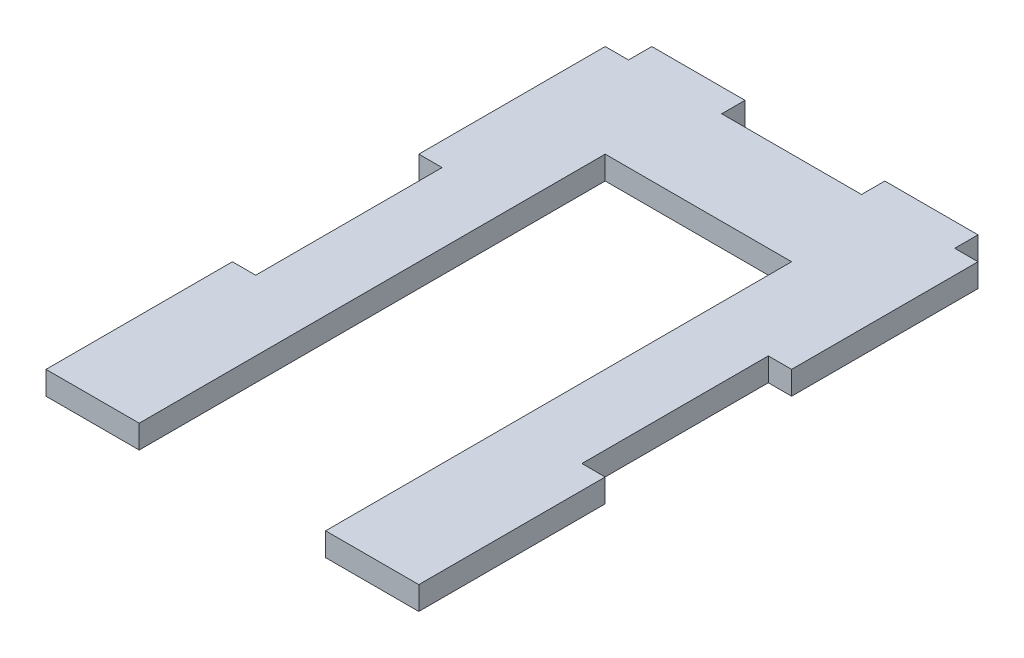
ISO-10303-21;
HEADER;
FILE_DESCRIPTION(('STEP AP214'),'2;1');
FILE_NAME('part.step','',(''),(''),'','','');
FILE_SCHEMA(('AUTOMOTIVE_DESIGN { 1 0 10303 214 1 1 1 1 }'));
ENDSEC;
DATA;
#1=APPLICATION_CONTEXT('core data for automotive mechanical design processes');
#2=APPLICATION_PROTOCOL_DEFINITION('international standard','automotive_design',2000,#1);
#3=PRODUCT_CONTEXT('',#1,'mechanical');
#4=PRODUCT('Part','Part','',(#3));
#5=PRODUCT_RELATED_PRODUCT_CATEGORY('part','',(#4));
#6=PRODUCT_DEFINITION_FORMATION('','',#4);
#7=PRODUCT_DEFINITION_CONTEXT('part definition',#1,'design');
#8=PRODUCT_DEFINITION('design','',#6,#7);
#9=PRODUCT_DEFINITION_SHAPE('','',#8);
#10=(LENGTH_UNIT() NAMED_UNIT(*) SI_UNIT(.MILLI.,.METRE.));
#11=(NAMED_UNIT(*) PLANE_ANGLE_UNIT() SI_UNIT($,.RADIAN.));
#12=(NAMED_UNIT(*) SI_UNIT($,.STERADIAN.) SOLID_ANGLE_UNIT());
#13=UNCERTAINTY_MEASURE_WITH_UNIT(LENGTH_MEASURE(1.E-05),#10,'distance_accuracy_value','');
#14=(GEOMETRIC_REPRESENTATION_CONTEXT(3) GLOBAL_UNCERTAINTY_ASSIGNED_CONTEXT((#13)) GLOBAL_UNIT_ASSIGNED_CONTEXT((#10,
#11,#12)) REPRESENTATION_CONTEXT('',''));
#15=CARTESIAN_POINT('',(0.,0.,0.));
#16=DIRECTION('',(0.,0.,1.));
#17=DIRECTION('',(1.,0.,0.));
#18=AXIS2_PLACEMENT_3D('',#15,#16,#17);
#19=CARTESIAN_POINT('',(-25.4,3.175,79.375));
#20=DIRECTION('',(1.,0.,0.));
#21=DIRECTION('',(0.,0.,-1.));
#22=AXIS2_PLACEMENT_3D('',#19,#20,#21);
#23=PLANE('',#22);
#24=DIRECTION('',(0.,0.,1.));
#25=VECTOR('',#24,1.);
#26=CARTESIAN_POINT('',(-25.4,0.,79.375));
#27=LINE('',#26,#25);
#28=CARTESIAN_POINT('',(-25.4,0.,53.975));
#29=VERTEX_POINT('',#28);
#30=CARTESIAN_POINT('',(-25.4,0.,79.375));
#31=VERTEX_POINT('',#30);
#32=EDGE_CURVE('E224',#29,#31,#27,.T.);
#33=ORIENTED_EDGE('',*,*,#32,.T.);
#34=DIRECTION('',(0.,-1.,0.));
#35=VECTOR('',#34,1.);
#36=CARTESIAN_POINT('',(-25.4,3.175,79.375));
#37=LINE('',#36,#35);
#38=CARTESIAN_POINT('',(-25.4,3.175,79.375));
#39=VERTEX_POINT('',#38);
#40=EDGE_CURVE('E11',#39,#31,#37,.T.);
#41=ORIENTED_EDGE('',*,*,#40,.F.);
#42=DIRECTION('',(0.,0.,1.));
#43=VECTOR('',#42,1.);
#44=CARTESIAN_POINT('',(-25.4,3.175,79.375));
#45=LINE('',#44,#43);
#46=CARTESIAN_POINT('',(-25.4,3.175,53.975));
#47=VERTEX_POINT('',#46);
#48=EDGE_CURVE('E271',#47,#39,#45,.T.);
#49=ORIENTED_EDGE('',*,*,#48,.F.);
#50=DIRECTION('',(0.,-1.,0.));
#51=VECTOR('',#50,1.);
#52=CARTESIAN_POINT('',(-25.4,3.175,53.975));
#53=LINE('',#52,#51);
#54=EDGE_CURVE('E220',#47,#29,#53,.T.);
#55=ORIENTED_EDGE('',*,*,#54,.T.);
#56=EDGE_LOOP('',(#33,#41,#49,#55));
#57=FACE_BOUND('',#56,.T.);
#58=ADVANCED_FACE('F32',(#57),#23,.F.);
#59=CARTESIAN_POINT('',(-22.225,3.175,79.375));
#60=DIRECTION('',(0.,0.,-1.));
#61=DIRECTION('',(-1.,0.,0.));
#62=AXIS2_PLACEMENT_3D('',#59,#60,#61);
#63=PLANE('',#62);
#64=DIRECTION('',(1.,0.,0.));
#65=VECTOR('',#64,1.);
#66=CARTESIAN_POINT('',(-22.225,0.,79.375));
#67=LINE('',#66,#65);
#68=CARTESIAN_POINT('',(-12.7,0.,79.375));
#69=VERTEX_POINT('',#68);
#70=EDGE_CURVE('E227',#31,#69,#67,.T.);
#71=ORIENTED_EDGE('',*,*,#70,.T.);
#72=DIRECTION('',(0.,-1.,0.));
#73=VECTOR('',#72,1.);
#74=CARTESIAN_POINT('',(-12.7,3.175,79.375));
#75=LINE('',#74,#73);
#76=CARTESIAN_POINT('',(-12.7,3.175,79.375));
#77=VERTEX_POINT('',#76);
#78=EDGE_CURVE('E40',#77,#69,#75,.T.);
#79=ORIENTED_EDGE('',*,*,#78,.F.);
#80=DIRECTION('',(1.,0.,0.));
#81=VECTOR('',#80,1.);
#82=CARTESIAN_POINT('',(-25.4,3.175,79.375));
#83=LINE('',#82,#81);
#84=EDGE_CURVE('E139',#39,#77,#83,.T.);
#85=ORIENTED_EDGE('',*,*,#84,.F.);
#86=ORIENTED_EDGE('',*,*,#40,.T.);
#87=EDGE_LOOP('',(#71,#79,#85,#86));
#88=FACE_BOUND('',#87,.T.);
#89=ADVANCED_FACE('F408',(#88),#63,.F.);
#90=CARTESIAN_POINT('',(-12.7,3.175,79.375));
#91=DIRECTION('',(-1.,0.,0.));
#92=DIRECTION('',(0.,0.,1.));
#93=AXIS2_PLACEMENT_3D('',#90,#91,#92);
#94=PLANE('',#93);
#95=DIRECTION('',(0.,0.,-1.));
#96=VECTOR('',#95,1.);
#97=CARTESIAN_POINT('',(-12.7,0.,79.375));
#98=LINE('',#97,#96);
#99=CARTESIAN_POINT('',(-12.7,0.,15.875));
#100=VERTEX_POINT('',#99);
#101=EDGE_CURVE('E229',#69,#100,#98,.T.);
#102=ORIENTED_EDGE('',*,*,#101,.T.);
#103=DIRECTION('',(0.,-1.,0.));
#104=VECTOR('',#103,1.);
#105=CARTESIAN_POINT('',(-12.7,3.175,15.875));
#106=LINE('',#105,#104);
#107=CARTESIAN_POINT('',(-12.7,3.175,15.875));
#108=VERTEX_POINT('',#107);
#109=EDGE_CURVE('E326',#108,#100,#106,.T.);
#110=ORIENTED_EDGE('',*,*,#109,.F.);
#111=DIRECTION('',(0.,0.,-1.));
#112=VECTOR('',#111,1.);
#113=CARTESIAN_POINT('',(-12.7,3.175,79.375));
#114=LINE('',#113,#112);
#115=EDGE_CURVE('E334',#77,#108,#114,.T.);
#116=ORIENTED_EDGE('',*,*,#115,.F.);
#117=ORIENTED_EDGE('',*,*,#78,.T.);
#118=EDGE_LOOP('',(#102,#110,#116,#117));
#119=FACE_BOUND('',#118,.T.);
#120=ADVANCED_FACE('F332',(#119),#94,.F.);
#121=CARTESIAN_POINT('',(-12.7,3.175,15.875));
#122=DIRECTION('',(0.,0.,-1.));
#123=DIRECTION('',(-1.,0.,0.));
#124=AXIS2_PLACEMENT_3D('',#121,#122,#123);
#125=PLANE('',#124);
#126=DIRECTION('',(1.,0.,0.));
#127=VECTOR('',#126,1.);
#128=CARTESIAN_POINT('',(-12.7,0.,15.875));
#129=LINE('',#128,#127);
#130=CARTESIAN_POINT('',(12.7,0.,15.875));
#131=VERTEX_POINT('',#130);
#132=EDGE_CURVE('E231',#100,#131,#129,.T.);
#133=ORIENTED_EDGE('',*,*,#132,.T.);
#134=DIRECTION('',(0.,-1.,0.));
#135=VECTOR('',#134,1.);
#136=CARTESIAN_POINT('',(12.7,3.175,15.875));
#137=LINE('',#136,#135);
#138=CARTESIAN_POINT('',(12.7,3.175,15.875));
#139=VERTEX_POINT('',#138);
#140=EDGE_CURVE('E323',#139,#131,#137,.T.);
#141=ORIENTED_EDGE('',*,*,#140,.F.);
#142=DIRECTION('',(1.,0.,0.));
#143=VECTOR('',#142,1.);
#144=CARTESIAN_POINT('',(-12.7,3.175,15.875));
#145=LINE('',#144,#143);
#146=EDGE_CURVE('E351',#108,#139,#145,.T.);
#147=ORIENTED_EDGE('',*,*,#146,.F.);
#148=ORIENTED_EDGE('',*,*,#109,.T.);
#149=EDGE_LOOP('',(#133,#141,#147,#148));
#150=FACE_BOUND('',#149,.T.);
#151=ADVANCED_FACE('F342',(#150),#125,.F.);
#152=CARTESIAN_POINT('',(12.7,3.175,79.375));
#153=DIRECTION('',(1.,0.,0.));
#154=DIRECTION('',(0.,0.,-1.));
#155=AXIS2_PLACEMENT_3D('',#152,#153,#154);
#156=PLANE('',#155);
#157=DIRECTION('',(0.,0.,1.));
#158=VECTOR('',#157,1.);
#159=CARTESIAN_POINT('',(12.7,0.,79.375));
#160=LINE('',#159,#158);
#161=CARTESIAN_POINT('',(12.7,0.,79.375));
#162=VERTEX_POINT('',#161);
#163=EDGE_CURVE('E233',#131,#162,#160,.T.);
#164=ORIENTED_EDGE('',*,*,#163,.T.);
#165=DIRECTION('',(0.,-1.,0.));
#166=VECTOR('',#165,1.);
#167=CARTESIAN_POINT('',(12.7,3.175,79.375));
#168=LINE('',#167,#166);
#169=CARTESIAN_POINT('',(12.7,3.175,79.375));
#170=VERTEX_POINT('',#169);
#171=EDGE_CURVE('E320',#170,#162,#168,.T.);
#172=ORIENTED_EDGE('',*,*,#171,.F.);
#173=DIRECTION('',(0.,0.,1.));
#174=VECTOR('',#173,1.);
#175=CARTESIAN_POINT('',(12.7,3.175,79.375));
#176=LINE('',#175,#174);
#177=EDGE_CURVE('E348',#139,#170,#176,.T.);
#178=ORIENTED_EDGE('',*,*,#177,.F.);
#179=ORIENTED_EDGE('',*,*,#140,.T.);
#180=EDGE_LOOP('',(#164,#172,#178,#179));
#181=FACE_BOUND('',#180,.T.);
#182=ADVANCED_FACE('F346',(#181),#156,.F.);
#183=CARTESIAN_POINT('',(25.4,3.175,79.375));
#184=DIRECTION('',(0.,0.,-1.));
#185=DIRECTION('',(-1.,0.,0.));
#186=AXIS2_PLACEMENT_3D('',#183,#184,#185);
#187=PLANE('',#186);
#188=DIRECTION('',(1.,0.,0.));
#189=VECTOR('',#188,1.);
#190=CARTESIAN_POINT('',(25.4,0.,79.375));
#191=LINE('',#190,#189);
#192=CARTESIAN_POINT('',(25.4,0.,79.375));
#193=VERTEX_POINT('',#192);
#194=EDGE_CURVE('E236',#162,#193,#191,.T.);
#195=ORIENTED_EDGE('',*,*,#194,.T.);
#196=DIRECTION('',(0.,-1.,0.));
#197=VECTOR('',#196,1.);
#198=CARTESIAN_POINT('',(25.4,3.175,79.375));
#199=LINE('',#198,#197);
#200=CARTESIAN_POINT('',(25.4,3.175,79.375));
#201=VERTEX_POINT('',#200);
#202=EDGE_CURVE('E317',#201,#193,#199,.T.);
#203=ORIENTED_EDGE('',*,*,#202,.F.);
#204=DIRECTION('',(1.,0.,0.));
#205=VECTOR('',#204,1.);
#206=CARTESIAN_POINT('',(12.7,3.175,79.375));
#207=LINE('',#206,#205);
#208=EDGE_CURVE('E350',#170,#201,#207,.T.);
#209=ORIENTED_EDGE('',*,*,#208,.F.);
#210=ORIENTED_EDGE('',*,*,#171,.T.);
#211=EDGE_LOOP('',(#195,#203,#209,#210));
#212=FACE_BOUND('',#211,.T.);
#213=ADVANCED_FACE('F421',(#212),#187,.F.);
#214=CARTESIAN_POINT('',(25.4,3.175,79.375));
#215=DIRECTION('',(-1.,0.,0.));
#216=DIRECTION('',(0.,0.,1.));
#217=AXIS2_PLACEMENT_3D('',#214,#215,#216);
#218=PLANE('',#217);
#219=DIRECTION('',(0.,0.,-1.));
#220=VECTOR('',#219,1.);
#221=CARTESIAN_POINT('',(25.4,0.,79.375));
#222=LINE('',#221,#220);
#223=CARTESIAN_POINT('',(25.4,0.,53.975));
#224=VERTEX_POINT('',#223);
#225=EDGE_CURVE('E238',#193,#224,#222,.T.);
#226=ORIENTED_EDGE('',*,*,#225,.T.);
#227=DIRECTION('',(0.,-1.,0.));
#228=VECTOR('',#227,1.);
#229=CARTESIAN_POINT('',(25.4,3.175,53.975));
#230=LINE('',#229,#228);
#231=CARTESIAN_POINT('',(25.4,3.175,53.975));
#232=VERTEX_POINT('',#231);
#233=EDGE_CURVE('E314',#232,#224,#230,.T.);
#234=ORIENTED_EDGE('',*,*,#233,.F.);
#235=DIRECTION('',(0.,0.,-1.));
#236=VECTOR('',#235,1.);
#237=CARTESIAN_POINT('',(25.4,3.175,79.375));
#238=LINE('',#237,#236);
#239=EDGE_CURVE('E353',#201,#232,#238,.T.);
#240=ORIENTED_EDGE('',*,*,#239,.F.);
#241=ORIENTED_EDGE('',*,*,#202,.T.);
#242=EDGE_LOOP('',(#226,#234,#240,#241));
#243=FACE_BOUND('',#242,.T.);
#244=ADVANCED_FACE('F424',(#243),#218,.F.);
#245=CARTESIAN_POINT('',(25.4,3.175,53.975));
#246=DIRECTION('',(0.,0.,1.));
#247=DIRECTION('',(1.,0.,0.));
#248=AXIS2_PLACEMENT_3D('',#245,#246,#247);
#249=PLANE('',#248);
#250=DIRECTION('',(-1.,0.,0.));
#251=VECTOR('',#250,1.);
#252=CARTESIAN_POINT('',(25.4,0.,53.975));
#253=LINE('',#252,#251);
#254=CARTESIAN_POINT('',(22.225,0.,53.975));
#255=VERTEX_POINT('',#254);
#256=EDGE_CURVE('E240',#224,#255,#253,.T.);
#257=ORIENTED_EDGE('',*,*,#256,.T.);
#258=DIRECTION('',(0.,-1.,0.));
#259=VECTOR('',#258,1.);
#260=CARTESIAN_POINT('',(22.225,3.175,53.975));
#261=LINE('',#260,#259);
#262=CARTESIAN_POINT('',(22.225,3.175,53.975));
#263=VERTEX_POINT('',#262);
#264=EDGE_CURVE('E311',#263,#255,#261,.T.);
#265=ORIENTED_EDGE('',*,*,#264,.F.);
#266=DIRECTION('',(-1.,0.,0.));
#267=VECTOR('',#266,1.);
#268=CARTESIAN_POINT('',(25.4,3.175,53.975));
#269=LINE('',#268,#267);
#270=EDGE_CURVE('E359',#232,#263,#269,.T.);
#271=ORIENTED_EDGE('',*,*,#270,.F.);
#272=ORIENTED_EDGE('',*,*,#233,.T.);
#273=EDGE_LOOP('',(#257,#265,#271,#272));
#274=FACE_BOUND('',#273,.T.);
#275=ADVANCED_FACE('F428',(#274),#249,.F.);
#276=CARTESIAN_POINT('',(22.225,3.175,28.575));
#277=DIRECTION('',(-1.,0.,0.));
#278=DIRECTION('',(0.,0.,1.));
#279=AXIS2_PLACEMENT_3D('',#276,#277,#278);
#280=PLANE('',#279);
#281=DIRECTION('',(0.,0.,-1.));
#282=VECTOR('',#281,1.);
#283=CARTESIAN_POINT('',(22.225,0.,28.575));
#284=LINE('',#283,#282);
#285=CARTESIAN_POINT('',(22.225,0.,28.575));
#286=VERTEX_POINT('',#285);
#287=EDGE_CURVE('E242',#255,#286,#284,.T.);
#288=ORIENTED_EDGE('',*,*,#287,.T.);
#289=DIRECTION('',(0.,-1.,0.));
#290=VECTOR('',#289,1.);
#291=CARTESIAN_POINT('',(22.225,3.175,28.575));
#292=LINE('',#291,#290);
#293=CARTESIAN_POINT('',(22.225,3.175,28.575));
#294=VERTEX_POINT('',#293);
#295=EDGE_CURVE('E308',#294,#286,#292,.T.);
#296=ORIENTED_EDGE('',*,*,#295,.F.);
#297=DIRECTION('',(0.,0.,-1.));
#298=VECTOR('',#297,1.);
#299=CARTESIAN_POINT('',(22.225,3.175,28.575));
#300=LINE('',#299,#298);
#301=EDGE_CURVE('E361',#263,#294,#300,.T.);
#302=ORIENTED_EDGE('',*,*,#301,.F.);
#303=ORIENTED_EDGE('',*,*,#264,.T.);
#304=EDGE_LOOP('',(#288,#296,#302,#303));
#305=FACE_BOUND('',#304,.T.);
#306=ADVANCED_FACE('F432',(#305),#280,.F.);
#307=CARTESIAN_POINT('',(25.4,3.175,28.575));
#308=DIRECTION('',(0.,0.,-1.));
#309=DIRECTION('',(-1.,0.,0.));
#310=AXIS2_PLACEMENT_3D('',#307,#308,#309);
#311=PLANE('',#310);
#312=DIRECTION('',(1.,0.,0.));
#313=VECTOR('',#312,1.);
#314=CARTESIAN_POINT('',(25.4,0.,28.575));
#315=LINE('',#314,#313);
#316=CARTESIAN_POINT('',(25.4,0.,28.575));
#317=VERTEX_POINT('',#316);
#318=EDGE_CURVE('E244',#286,#317,#315,.T.);
#319=ORIENTED_EDGE('',*,*,#318,.T.);
#320=DIRECTION('',(0.,-1.,0.));
#321=VECTOR('',#320,1.);
#322=CARTESIAN_POINT('',(25.4,3.175,28.575));
#323=LINE('',#322,#321);
#324=CARTESIAN_POINT('',(25.4,3.175,28.575));
#325=VERTEX_POINT('',#324);
#326=EDGE_CURVE('E305',#325,#317,#323,.T.);
#327=ORIENTED_EDGE('',*,*,#326,.F.);
#328=DIRECTION('',(1.,0.,0.));
#329=VECTOR('',#328,1.);
#330=CARTESIAN_POINT('',(25.4,3.175,28.575));
#331=LINE('',#330,#329);
#332=EDGE_CURVE('E363',#294,#325,#331,.T.);
#333=ORIENTED_EDGE('',*,*,#332,.F.);
#334=ORIENTED_EDGE('',*,*,#295,.T.);
#335=EDGE_LOOP('',(#319,#327,#333,#334));
#336=FACE_BOUND('',#335,.T.);
#337=ADVANCED_FACE('F436',(#336),#311,.F.);
#338=CARTESIAN_POINT('',(25.4,3.175,3.17499999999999));
#339=DIRECTION('',(-1.,0.,0.));
#340=DIRECTION('',(0.,0.,1.));
#341=AXIS2_PLACEMENT_3D('',#338,#339,#340);
#342=PLANE('',#341);
#343=DIRECTION('',(0.,0.,-1.));
#344=VECTOR('',#343,1.);
#345=CARTESIAN_POINT('',(25.4,0.,3.17499999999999));
#346=LINE('',#345,#344);
#347=CARTESIAN_POINT('',(25.4,0.,3.17499999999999));
#348=VERTEX_POINT('',#347);
#349=EDGE_CURVE('E246',#317,#348,#346,.T.);
#350=ORIENTED_EDGE('',*,*,#349,.T.);
#351=DIRECTION('',(0.,-1.,0.));
#352=VECTOR('',#351,1.);
#353=CARTESIAN_POINT('',(25.4,3.175,3.17499999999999));
#354=LINE('',#353,#352);
#355=CARTESIAN_POINT('',(25.4,3.175,3.17499999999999));
#356=VERTEX_POINT('',#355);
#357=EDGE_CURVE('E302',#356,#348,#354,.T.);
#358=ORIENTED_EDGE('',*,*,#357,.F.);
#359=DIRECTION('',(0.,0.,-1.));
#360=VECTOR('',#359,1.);
#361=CARTESIAN_POINT('',(25.4,3.175,3.17499999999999));
#362=LINE('',#361,#360);
#363=EDGE_CURVE('E365',#325,#356,#362,.T.);
#364=ORIENTED_EDGE('',*,*,#363,.F.);
#365=ORIENTED_EDGE('',*,*,#326,.T.);
#366=EDGE_LOOP('',(#350,#358,#364,#365));
#367=FACE_BOUND('',#366,.T.);
#368=ADVANCED_FACE('F440',(#367),#342,.F.);
#369=CARTESIAN_POINT('',(22.225,3.175,3.17499999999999));
#370=DIRECTION('',(0.,0.,1.));
#371=DIRECTION('',(1.,0.,0.));
#372=AXIS2_PLACEMENT_3D('',#369,#370,#371);
#373=PLANE('',#372);
#374=DIRECTION('',(-1.,0.,0.));
#375=VECTOR('',#374,1.);
#376=CARTESIAN_POINT('',(22.225,0.,3.17499999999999));
#377=LINE('',#376,#375);
#378=CARTESIAN_POINT('',(22.225,0.,3.17499999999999));
#379=VERTEX_POINT('',#378);
#380=EDGE_CURVE('E248',#348,#379,#377,.T.);
#381=ORIENTED_EDGE('',*,*,#380,.T.);
#382=DIRECTION('',(0.,-1.,0.));
#383=VECTOR('',#382,1.);
#384=CARTESIAN_POINT('',(22.225,3.175,3.17499999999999));
#385=LINE('',#384,#383);
#386=CARTESIAN_POINT('',(22.225,3.175,3.17499999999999));
#387=VERTEX_POINT('',#386);
#388=EDGE_CURVE('E299',#387,#379,#385,.T.);
#389=ORIENTED_EDGE('',*,*,#388,.F.);
#390=DIRECTION('',(-1.,0.,0.));
#391=VECTOR('',#390,1.);
#392=CARTESIAN_POINT('',(22.225,3.175,3.17499999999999));
#393=LINE('',#392,#391);
#394=EDGE_CURVE('E367',#356,#387,#393,.T.);
#395=ORIENTED_EDGE('',*,*,#394,.F.);
#396=ORIENTED_EDGE('',*,*,#357,.T.);
#397=EDGE_LOOP('',(#381,#389,#395,#396));
#398=FACE_BOUND('',#397,.T.);
#399=ADVANCED_FACE('F444',(#398),#373,.F.);
#400=CARTESIAN_POINT('',(22.225,3.175,0.));
#401=DIRECTION('',(-1.,0.,0.));
#402=DIRECTION('',(0.,0.,1.));
#403=AXIS2_PLACEMENT_3D('',#400,#401,#402);
#404=PLANE('',#403);
#405=DIRECTION('',(0.,0.,-1.));
#406=VECTOR('',#405,1.);
#407=CARTESIAN_POINT('',(22.225,0.,0.));
#408=LINE('',#407,#406);
#409=CARTESIAN_POINT('',(22.225,0.,0.));
#410=VERTEX_POINT('',#409);
#411=EDGE_CURVE('E250',#379,#410,#408,.T.);
#412=ORIENTED_EDGE('',*,*,#411,.T.);
#413=DIRECTION('',(0.,-1.,0.));
#414=VECTOR('',#413,1.);
#415=CARTESIAN_POINT('',(22.225,3.175,0.));
#416=LINE('',#415,#414);
#417=CARTESIAN_POINT('',(22.225,3.175,0.));
#418=VERTEX_POINT('',#417);
#419=EDGE_CURVE('E296',#418,#410,#416,.T.);
#420=ORIENTED_EDGE('',*,*,#419,.F.);
#421=DIRECTION('',(0.,0.,-1.));
#422=VECTOR('',#421,1.);
#423=CARTESIAN_POINT('',(22.225,3.175,0.));
#424=LINE('',#423,#422);
#425=EDGE_CURVE('E369',#387,#418,#424,.T.);
#426=ORIENTED_EDGE('',*,*,#425,.F.);
#427=ORIENTED_EDGE('',*,*,#388,.T.);
#428=EDGE_LOOP('',(#412,#420,#426,#427));
#429=FACE_BOUND('',#428,.T.);
#430=ADVANCED_FACE('F448',(#429),#404,.F.);
#431=CARTESIAN_POINT('',(22.225,3.175,0.));
#432=DIRECTION('',(0.,0.,1.));
#433=DIRECTION('',(1.,0.,0.));
#434=AXIS2_PLACEMENT_3D('',#431,#432,#433);
#435=PLANE('',#434);
#436=DIRECTION('',(-1.,0.,0.));
#437=VECTOR('',#436,1.);
#438=CARTESIAN_POINT('',(22.225,0.,0.));
#439=LINE('',#438,#437);
#440=CARTESIAN_POINT('',(9.52499999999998,0.,0.));
#441=VERTEX_POINT('',#440);
#442=EDGE_CURVE('E252',#410,#441,#439,.T.);
#443=ORIENTED_EDGE('',*,*,#442,.T.);
#444=DIRECTION('',(0.,-1.,0.));
#445=VECTOR('',#444,1.);
#446=CARTESIAN_POINT('',(9.52499999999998,3.175,0.));
#447=LINE('',#446,#445);
#448=CARTESIAN_POINT('',(9.52499999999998,3.175,0.));
#449=VERTEX_POINT('',#448);
#450=EDGE_CURVE('E293',#449,#441,#447,.T.);
#451=ORIENTED_EDGE('',*,*,#450,.F.);
#452=DIRECTION('',(-1.,0.,0.));
#453=VECTOR('',#452,1.);
#454=CARTESIAN_POINT('',(22.225,3.175,0.));
#455=LINE('',#454,#453);
#456=EDGE_CURVE('E371',#418,#449,#455,.T.);
#457=ORIENTED_EDGE('',*,*,#456,.F.);
#458=ORIENTED_EDGE('',*,*,#419,.T.);
#459=EDGE_LOOP('',(#443,#451,#457,#458));
#460=FACE_BOUND('',#459,.T.);
#461=ADVANCED_FACE('F452',(#460),#435,.F.);
#462=CARTESIAN_POINT('',(9.52499999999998,3.175,0.));
#463=DIRECTION('',(1.,0.,0.));
#464=DIRECTION('',(0.,0.,-1.));
#465=AXIS2_PLACEMENT_3D('',#462,#463,#464);
#466=PLANE('',#465);
#467=DIRECTION('',(0.,0.,1.));
#468=VECTOR('',#467,1.);
#469=CARTESIAN_POINT('',(9.52499999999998,0.,0.));
#470=LINE('',#469,#468);
#471=CARTESIAN_POINT('',(9.52499999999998,0.,3.17499999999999));
#472=VERTEX_POINT('',#471);
#473=EDGE_CURVE('E254',#441,#472,#470,.T.);
#474=ORIENTED_EDGE('',*,*,#473,.T.);
#475=DIRECTION('',(0.,-1.,0.));
#476=VECTOR('',#475,1.);
#477=CARTESIAN_POINT('',(9.52499999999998,3.175,3.17499999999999));
#478=LINE('',#477,#476);
#479=CARTESIAN_POINT('',(9.52499999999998,3.175,3.17499999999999));
#480=VERTEX_POINT('',#479);
#481=EDGE_CURVE('E290',#480,#472,#478,.T.);
#482=ORIENTED_EDGE('',*,*,#481,.F.);
#483=DIRECTION('',(0.,0.,1.));
#484=VECTOR('',#483,1.);
#485=CARTESIAN_POINT('',(9.52499999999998,3.175,0.));
#486=LINE('',#485,#484);
#487=EDGE_CURVE('E373',#449,#480,#486,.T.);
#488=ORIENTED_EDGE('',*,*,#487,.F.);
#489=ORIENTED_EDGE('',*,*,#450,.T.);
#490=EDGE_LOOP('',(#474,#482,#488,#489));
#491=FACE_BOUND('',#490,.T.);
#492=ADVANCED_FACE('F456',(#491),#466,.F.);
#493=CARTESIAN_POINT('',(-9.52500000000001,3.175,3.17499999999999));
#494=DIRECTION('',(0.,0.,1.));
#495=DIRECTION('',(1.,0.,0.));
#496=AXIS2_PLACEMENT_3D('',#493,#494,#495);
#497=PLANE('',#496);
#498=DIRECTION('',(-1.,0.,0.));
#499=VECTOR('',#498,1.);
#500=CARTESIAN_POINT('',(-9.52500000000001,0.,3.17499999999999));
#501=LINE('',#500,#499);
#502=CARTESIAN_POINT('',(-9.52500000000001,0.,3.17499999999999));
#503=VERTEX_POINT('',#502);
#504=EDGE_CURVE('E256',#472,#503,#501,.T.);
#505=ORIENTED_EDGE('',*,*,#504,.T.);
#506=DIRECTION('',(0.,-1.,0.));
#507=VECTOR('',#506,1.);
#508=CARTESIAN_POINT('',(-9.52500000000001,3.175,3.17499999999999));
#509=LINE('',#508,#507);
#510=CARTESIAN_POINT('',(-9.52500000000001,3.175,3.17499999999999));
#511=VERTEX_POINT('',#510);
#512=EDGE_CURVE('E287',#511,#503,#509,.T.);
#513=ORIENTED_EDGE('',*,*,#512,.F.);
#514=DIRECTION('',(-1.,0.,0.));
#515=VECTOR('',#514,1.);
#516=CARTESIAN_POINT('',(-9.52500000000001,3.175,3.17499999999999));
#517=LINE('',#516,#515);
#518=EDGE_CURVE('E375',#480,#511,#517,.T.);
#519=ORIENTED_EDGE('',*,*,#518,.F.);
#520=ORIENTED_EDGE('',*,*,#481,.T.);
#521=EDGE_LOOP('',(#505,#513,#519,#520));
#522=FACE_BOUND('',#521,.T.);
#523=ADVANCED_FACE('F460',(#522),#497,.F.);
#524=CARTESIAN_POINT('',(-9.52500000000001,3.175,0.));
#525=DIRECTION('',(-1.,0.,0.));
#526=DIRECTION('',(0.,0.,1.));
#527=AXIS2_PLACEMENT_3D('',#524,#525,#526);
#528=PLANE('',#527);
#529=DIRECTION('',(0.,0.,-1.));
#530=VECTOR('',#529,1.);
#531=CARTESIAN_POINT('',(-9.52500000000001,0.,0.));
#532=LINE('',#531,#530);
#533=CARTESIAN_POINT('',(-9.52500000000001,0.,0.));
#534=VERTEX_POINT('',#533);
#535=EDGE_CURVE('E258',#503,#534,#532,.T.);
#536=ORIENTED_EDGE('',*,*,#535,.T.);
#537=DIRECTION('',(0.,-1.,0.));
#538=VECTOR('',#537,1.);
#539=CARTESIAN_POINT('',(-9.52500000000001,3.175,0.));
#540=LINE('',#539,#538);
#541=CARTESIAN_POINT('',(-9.52500000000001,3.175,0.));
#542=VERTEX_POINT('',#541);
#543=EDGE_CURVE('E284',#542,#534,#540,.T.);
#544=ORIENTED_EDGE('',*,*,#543,.F.);
#545=DIRECTION('',(0.,0.,-1.));
#546=VECTOR('',#545,1.);
#547=CARTESIAN_POINT('',(-9.52500000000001,3.175,0.));
#548=LINE('',#547,#546);
#549=EDGE_CURVE('E377',#511,#542,#548,.T.);
#550=ORIENTED_EDGE('',*,*,#549,.F.);
#551=ORIENTED_EDGE('',*,*,#512,.T.);
#552=EDGE_LOOP('',(#536,#544,#550,#551));
#553=FACE_BOUND('',#552,.T.);
#554=ADVANCED_FACE('F464',(#553),#528,.F.);
#555=CARTESIAN_POINT('',(-22.225,3.175,0.));
#556=DIRECTION('',(0.,0.,1.));
#557=DIRECTION('',(1.,0.,0.));
#558=AXIS2_PLACEMENT_3D('',#555,#556,#557);
#559=PLANE('',#558);
#560=DIRECTION('',(-1.,0.,0.));
#561=VECTOR('',#560,1.);
#562=CARTESIAN_POINT('',(-22.225,0.,0.));
#563=LINE('',#562,#561);
#564=CARTESIAN_POINT('',(-22.225,0.,0.));
#565=VERTEX_POINT('',#564);
#566=EDGE_CURVE('E260',#534,#565,#563,.T.);
#567=ORIENTED_EDGE('',*,*,#566,.T.);
#568=DIRECTION('',(0.,-1.,0.));
#569=VECTOR('',#568,1.);
#570=CARTESIAN_POINT('',(-22.225,3.175,0.));
#571=LINE('',#570,#569);
#572=CARTESIAN_POINT('',(-22.225,3.175,0.));
#573=VERTEX_POINT('',#572);
#574=EDGE_CURVE('E281',#573,#565,#571,.T.);
#575=ORIENTED_EDGE('',*,*,#574,.F.);
#576=DIRECTION('',(-1.,0.,0.));
#577=VECTOR('',#576,1.);
#578=CARTESIAN_POINT('',(-22.225,3.175,0.));
#579=LINE('',#578,#577);
#580=EDGE_CURVE('E379',#542,#573,#579,.T.);
#581=ORIENTED_EDGE('',*,*,#580,.F.);
#582=ORIENTED_EDGE('',*,*,#543,.T.);
#583=EDGE_LOOP('',(#567,#575,#581,#582));
#584=FACE_BOUND('',#583,.T.);
#585=ADVANCED_FACE('F468',(#584),#559,.F.);
#586=CARTESIAN_POINT('',(-22.225,3.175,0.));
#587=DIRECTION('',(1.,0.,0.));
#588=DIRECTION('',(0.,0.,-1.));
#589=AXIS2_PLACEMENT_3D('',#586,#587,#588);
#590=PLANE('',#589);
#591=DIRECTION('',(0.,0.,1.));
#592=VECTOR('',#591,1.);
#593=CARTESIAN_POINT('',(-22.225,0.,0.));
#594=LINE('',#593,#592);
#595=CARTESIAN_POINT('',(-22.225,0.,3.17499999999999));
#596=VERTEX_POINT('',#595);
#597=EDGE_CURVE('E262',#565,#596,#594,.T.);
#598=ORIENTED_EDGE('',*,*,#597,.T.);
#599=DIRECTION('',(0.,-1.,0.));
#600=VECTOR('',#599,1.);
#601=CARTESIAN_POINT('',(-22.225,3.175,3.17499999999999));
#602=LINE('',#601,#600);
#603=CARTESIAN_POINT('',(-22.225,3.175,3.17499999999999));
#604=VERTEX_POINT('',#603);
#605=EDGE_CURVE('E278',#604,#596,#602,.T.);
#606=ORIENTED_EDGE('',*,*,#605,.F.);
#607=DIRECTION('',(0.,0.,1.));
#608=VECTOR('',#607,1.);
#609=CARTESIAN_POINT('',(-22.225,3.175,0.));
#610=LINE('',#609,#608);
#611=EDGE_CURVE('E381',#573,#604,#610,.T.);
#612=ORIENTED_EDGE('',*,*,#611,.F.);
#613=ORIENTED_EDGE('',*,*,#574,.T.);
#614=EDGE_LOOP('',(#598,#606,#612,#613));
#615=FACE_BOUND('',#614,.T.);
#616=ADVANCED_FACE('F472',(#615),#590,.F.);
#617=CARTESIAN_POINT('',(-25.4,3.175,3.17499999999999));
#618=DIRECTION('',(0.,0.,1.));
#619=DIRECTION('',(1.,0.,0.));
#620=AXIS2_PLACEMENT_3D('',#617,#618,#619);
#621=PLANE('',#620);
#622=DIRECTION('',(-1.,0.,0.));
#623=VECTOR('',#622,1.);
#624=CARTESIAN_POINT('',(-25.4,0.,3.17499999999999));
#625=LINE('',#624,#623);
#626=CARTESIAN_POINT('',(-25.4,0.,3.17499999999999));
#627=VERTEX_POINT('',#626);
#628=EDGE_CURVE('E264',#596,#627,#625,.T.);
#629=ORIENTED_EDGE('',*,*,#628,.T.);
#630=DIRECTION('',(0.,-1.,0.));
#631=VECTOR('',#630,1.);
#632=CARTESIAN_POINT('',(-25.4,3.175,3.17499999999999));
#633=LINE('',#632,#631);
#634=CARTESIAN_POINT('',(-25.4,3.175,3.17499999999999));
#635=VERTEX_POINT('',#634);
#636=EDGE_CURVE('E275',#635,#627,#633,.T.);
#637=ORIENTED_EDGE('',*,*,#636,.F.);
#638=DIRECTION('',(-1.,0.,0.));
#639=VECTOR('',#638,1.);
#640=CARTESIAN_POINT('',(-25.4,3.175,3.17499999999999));
#641=LINE('',#640,#639);
#642=EDGE_CURVE('E383',#604,#635,#641,.T.);
#643=ORIENTED_EDGE('',*,*,#642,.F.);
#644=ORIENTED_EDGE('',*,*,#605,.T.);
#645=EDGE_LOOP('',(#629,#637,#643,#644));
#646=FACE_BOUND('',#645,.T.);
#647=ADVANCED_FACE('F389',(#646),#621,.F.);
#648=CARTESIAN_POINT('',(-25.4,3.175,3.17499999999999));
#649=DIRECTION('',(1.,0.,0.));
#650=DIRECTION('',(0.,0.,-1.));
#651=AXIS2_PLACEMENT_3D('',#648,#649,#650);
#652=PLANE('',#651);
#653=DIRECTION('',(0.,0.,1.));
#654=VECTOR('',#653,1.);
#655=CARTESIAN_POINT('',(-25.4,0.,3.17499999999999));
#656=LINE('',#655,#654);
#657=CARTESIAN_POINT('',(-25.4,0.,28.575));
#658=VERTEX_POINT('',#657);
#659=EDGE_CURVE('E266',#627,#658,#656,.T.);
#660=ORIENTED_EDGE('',*,*,#659,.T.);
#661=DIRECTION('',(0.,-1.,0.));
#662=VECTOR('',#661,1.);
#663=CARTESIAN_POINT('',(-25.4,3.175,28.575));
#664=LINE('',#663,#662);
#665=CARTESIAN_POINT('',(-25.4,3.175,28.575));
#666=VERTEX_POINT('',#665);
#667=EDGE_CURVE('E215',#666,#658,#664,.T.);
#668=ORIENTED_EDGE('',*,*,#667,.F.);
#669=DIRECTION('',(0.,0.,1.));
#670=VECTOR('',#669,1.);
#671=CARTESIAN_POINT('',(-25.4,3.175,3.17499999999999));
#672=LINE('',#671,#670);
#673=EDGE_CURVE('E206',#635,#666,#672,.T.);
#674=ORIENTED_EDGE('',*,*,#673,.F.);
#675=ORIENTED_EDGE('',*,*,#636,.T.);
#676=EDGE_LOOP('',(#660,#668,#674,#675));
#677=FACE_BOUND('',#676,.T.);
#678=ADVANCED_FACE('F393',(#677),#652,.F.);
#679=CARTESIAN_POINT('',(-25.4,3.175,28.575));
#680=DIRECTION('',(0.,0.,-1.));
#681=DIRECTION('',(-1.,0.,0.));
#682=AXIS2_PLACEMENT_3D('',#679,#680,#681);
#683=PLANE('',#682);
#684=DIRECTION('',(1.,0.,0.));
#685=VECTOR('',#684,1.);
#686=CARTESIAN_POINT('',(-25.4,0.,28.575));
#687=LINE('',#686,#685);
#688=CARTESIAN_POINT('',(-22.225,0.,28.575));
#689=VERTEX_POINT('',#688);
#690=EDGE_CURVE('E214',#658,#689,#687,.T.);
#691=ORIENTED_EDGE('',*,*,#690,.T.);
#692=DIRECTION('',(0.,-1.,0.));
#693=VECTOR('',#692,1.);
#694=CARTESIAN_POINT('',(-22.225,3.175,28.575));
#695=LINE('',#694,#693);
#696=CARTESIAN_POINT('',(-22.225,3.175,28.575));
#697=VERTEX_POINT('',#696);
#698=EDGE_CURVE('E211',#697,#689,#695,.T.);
#699=ORIENTED_EDGE('',*,*,#698,.F.);
#700=DIRECTION('',(1.,0.,0.));
#701=VECTOR('',#700,1.);
#702=CARTESIAN_POINT('',(-25.4,3.175,28.575));
#703=LINE('',#702,#701);
#704=EDGE_CURVE('E200',#666,#697,#703,.T.);
#705=ORIENTED_EDGE('',*,*,#704,.F.);
#706=ORIENTED_EDGE('',*,*,#667,.T.);
#707=EDGE_LOOP('',(#691,#699,#705,#706));
#708=FACE_BOUND('',#707,.T.);
#709=ADVANCED_FACE('F212',(#708),#683,.F.);
#710=CARTESIAN_POINT('',(-22.225,3.175,28.575));
#711=DIRECTION('',(1.,0.,0.));
#712=DIRECTION('',(0.,0.,-1.));
#713=AXIS2_PLACEMENT_3D('',#710,#711,#712);
#714=PLANE('',#713);
#715=DIRECTION('',(0.,0.,1.));
#716=VECTOR('',#715,1.);
#717=CARTESIAN_POINT('',(-22.225,0.,28.575));
#718=LINE('',#717,#716);
#719=CARTESIAN_POINT('',(-22.225,0.,53.975));
#720=VERTEX_POINT('',#719);
#721=EDGE_CURVE('E125',#689,#720,#718,.T.);
#722=ORIENTED_EDGE('',*,*,#721,.T.);
#723=DIRECTION('',(0.,-1.,0.));
#724=VECTOR('',#723,1.);
#725=CARTESIAN_POINT('',(-22.225,3.175,53.975));
#726=LINE('',#725,#724);
#727=CARTESIAN_POINT('',(-22.225,3.175,53.975));
#728=VERTEX_POINT('',#727);
#729=EDGE_CURVE('E216',#728,#720,#726,.T.);
#730=ORIENTED_EDGE('',*,*,#729,.F.);
#731=DIRECTION('',(0.,0.,1.));
#732=VECTOR('',#731,1.);
#733=CARTESIAN_POINT('',(-22.225,3.175,28.575));
#734=LINE('',#733,#732);
#735=EDGE_CURVE('E204',#697,#728,#734,.T.);
#736=ORIENTED_EDGE('',*,*,#735,.F.);
#737=ORIENTED_EDGE('',*,*,#698,.T.);
#738=EDGE_LOOP('',(#722,#730,#736,#737));
#739=FACE_BOUND('',#738,.T.);
#740=ADVANCED_FACE('F218',(#739),#714,.F.);
#741=CARTESIAN_POINT('',(-25.4,3.175,53.975));
#742=DIRECTION('',(0.,0.,1.));
#743=DIRECTION('',(1.,0.,0.));
#744=AXIS2_PLACEMENT_3D('',#741,#742,#743);
#745=PLANE('',#744);
#746=DIRECTION('',(-1.,0.,0.));
#747=VECTOR('',#746,1.);
#748=CARTESIAN_POINT('',(-25.4,0.,53.975));
#749=LINE('',#748,#747);
#750=EDGE_CURVE('E131',#720,#29,#749,.T.);
#751=ORIENTED_EDGE('',*,*,#750,.T.);
#752=ORIENTED_EDGE('',*,*,#54,.F.);
#753=DIRECTION('',(-1.,0.,0.));
#754=VECTOR('',#753,1.);
#755=CARTESIAN_POINT('',(-25.4,3.175,53.975));
#756=LINE('',#755,#754);
#757=EDGE_CURVE('E48',#728,#47,#756,.T.);
#758=ORIENTED_EDGE('',*,*,#757,.F.);
#759=ORIENTED_EDGE('',*,*,#729,.T.);
#760=EDGE_LOOP('',(#751,#752,#758,#759));
#761=FACE_BOUND('',#760,.T.);
#762=ADVANCED_FACE('F397',(#761),#745,.F.);
#763=CARTESIAN_POINT('',(-25.4,3.175,53.975));
#764=DIRECTION('',(0.,-1.,0.));
#765=DIRECTION('',(0.,0.,-1.));
#766=AXIS2_PLACEMENT_3D('',#763,#764,#765);
#767=PLANE('',#766);
#768=ORIENTED_EDGE('',*,*,#48,.T.);
#769=ORIENTED_EDGE('',*,*,#84,.T.);
#770=ORIENTED_EDGE('',*,*,#115,.T.);
#771=ORIENTED_EDGE('',*,*,#146,.T.);
#772=ORIENTED_EDGE('',*,*,#177,.T.);
#773=ORIENTED_EDGE('',*,*,#208,.T.);
#774=ORIENTED_EDGE('',*,*,#239,.T.);
#775=ORIENTED_EDGE('',*,*,#270,.T.);
#776=ORIENTED_EDGE('',*,*,#301,.T.);
#777=ORIENTED_EDGE('',*,*,#332,.T.);
#778=ORIENTED_EDGE('',*,*,#363,.T.);
#779=ORIENTED_EDGE('',*,*,#394,.T.);
#780=ORIENTED_EDGE('',*,*,#425,.T.);
#781=ORIENTED_EDGE('',*,*,#456,.T.);
#782=ORIENTED_EDGE('',*,*,#487,.T.);
#783=ORIENTED_EDGE('',*,*,#518,.T.);
#784=ORIENTED_EDGE('',*,*,#549,.T.);
#785=ORIENTED_EDGE('',*,*,#580,.T.);
#786=ORIENTED_EDGE('',*,*,#611,.T.);
#787=ORIENTED_EDGE('',*,*,#642,.T.);
#788=ORIENTED_EDGE('',*,*,#673,.T.);
#789=ORIENTED_EDGE('',*,*,#704,.T.);
#790=ORIENTED_EDGE('',*,*,#735,.T.);
#791=ORIENTED_EDGE('',*,*,#757,.T.);
#792=EDGE_LOOP('',(#768,#769,#770,#771,#772,#773,#774,#775,#776,#777,#778,#779,#780,#781,#782,
#783,#784,#785,#786,#787,#788,#789,#790,#791));
#793=FACE_BOUND('',#792,.T.);
#794=ADVANCED_FACE('F202',(#793),#767,.F.);
#795=CARTESIAN_POINT('',(-25.4,0.,53.975));
#796=DIRECTION('',(0.,-1.,0.));
#797=DIRECTION('',(0.,0.,-1.));
#798=AXIS2_PLACEMENT_3D('',#795,#796,#797);
#799=PLANE('',#798);
#800=ORIENTED_EDGE('',*,*,#32,.F.);
#801=ORIENTED_EDGE('',*,*,#750,.F.);
#802=ORIENTED_EDGE('',*,*,#721,.F.);
#803=ORIENTED_EDGE('',*,*,#690,.F.);
#804=ORIENTED_EDGE('',*,*,#659,.F.);
#805=ORIENTED_EDGE('',*,*,#628,.F.);
#806=ORIENTED_EDGE('',*,*,#597,.F.);
#807=ORIENTED_EDGE('',*,*,#566,.F.);
#808=ORIENTED_EDGE('',*,*,#535,.F.);
#809=ORIENTED_EDGE('',*,*,#504,.F.);
#810=ORIENTED_EDGE('',*,*,#473,.F.);
#811=ORIENTED_EDGE('',*,*,#442,.F.);
#812=ORIENTED_EDGE('',*,*,#411,.F.);
#813=ORIENTED_EDGE('',*,*,#380,.F.);
#814=ORIENTED_EDGE('',*,*,#349,.F.);
#815=ORIENTED_EDGE('',*,*,#318,.F.);
#816=ORIENTED_EDGE('',*,*,#287,.F.);
#817=ORIENTED_EDGE('',*,*,#256,.F.);
#818=ORIENTED_EDGE('',*,*,#225,.F.);
#819=ORIENTED_EDGE('',*,*,#194,.F.);
#820=ORIENTED_EDGE('',*,*,#163,.F.);
#821=ORIENTED_EDGE('',*,*,#132,.F.);
#822=ORIENTED_EDGE('',*,*,#101,.F.);
#823=ORIENTED_EDGE('',*,*,#70,.F.);
#824=EDGE_LOOP('',(#800,#801,#802,#803,#804,#805,#806,#807,#808,#809,#810,#811,#812,#813,#814,
#815,#816,#817,#818,#819,#820,#821,#822,#823));
#825=FACE_BOUND('',#824,.T.);
#826=ADVANCED_FACE('F338',(#825),#799,.T.);
#827=CLOSED_SHELL('',(#58,#89,#120,#151,#182,#213,#244,#275,#306,#337,#368,#399,#430,#461,#492,
#523,#554,#585,#616,#647,#678,#709,#740,#762,#794,#826));
#828=MANIFOLD_SOLID_BREP('B2',#827);
#829=ADVANCED_BREP_SHAPE_REPRESENTATION('',(#18,#828),#14);
#830=SHAPE_DEFINITION_REPRESENTATION(#9,#829);
ENDSEC;
END-ISO-10303-21;
